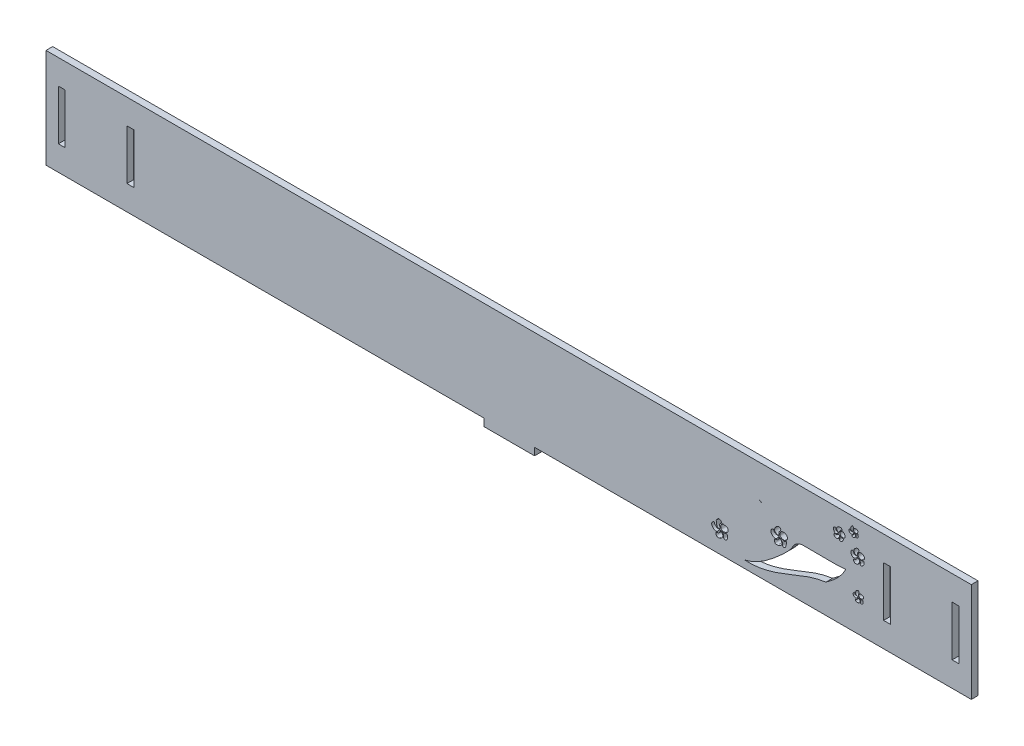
from build123d import *

# Parameters (mm, degrees)
SKETCH1_W           = 2.76
SKETCH1_H           = 20.24
BOSS_EXTRUDE1_DEPTH = 2.7


with BuildPart() as part:
    # Sketch1 → Boss-Extrude1 (new body)
    with BuildSketch(Plane.XY):
        Polygon((67.19335, -20.12), (187.24385, -20.12), (187.24385, 20.12), (67.19335, 20.12), (63.19335, 20.12), (59.19335, 20.12), (55.19335, 20.12), (51.19335, 20.12), (47.19335, 20.12), (43.19335, 20.12), (39.19335, 20.12), (35.19335, 20.12), (31.19335, 20.12), (27.19335, 20.12), (23.19335, 20.12), (19.19335, 20.12), (-19.19335, 20.12), (-23.19335, 20.12), (-27.19335, 20.12), (-31.19335, 20.12), (-35.19335, 20.12), (-39.19335, 20.12), (-43.19335, 20.12), (-47.19335, 20.12), (-51.19335, 20.12), (-55.19335, 20.12), (-59.19335, 20.12), (-63.19335, 20.12), (-67.19335, 20.12), (-187.24385, 20.12), (-187.24385, -20.12), (-67.19335, -20.12), (-63.19335, -20.12), (-59.19335, -20.12), (-55.19335, -20.12), (-51.19335, -20.12), (-47.19335, -20.12), (-43.19335, -20.12), (-39.19335, -20.12), (-35.19335, -20.12), (-31.19335, -20.12), (-27.19335, -20.12), (-23.19335, -20.12), (-19.19335, -20.12), (-10, -20.12), (-10, -23.12), (10.48, -23.12), (10.48, -20.12), (19.19335, -20.12), (23.19335, -20.12), (27.19335, -20.12), (31.19335, -20.12), (35.19335, -20.12), (39.19335, -20.12), (43.19335, -20.12), (47.19335, -20.12), (51.19335, -20.12), (55.19335, -20.12), (59.19335, -20.12), (63.19335, -20.12), align=None)
        with BuildLine():
            add(Edge.make_bspline(
                [(85.691208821, -11.629466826), (85.589736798, -11.701100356), (85.568065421, -12.501909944), (84.868688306, -13.026090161), (83.77266919, -12.995510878), (83.850437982, -13.919274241), (84.300409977, -14.683280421), (85.491883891, -14.55872955), (86.452284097, -14.04142668), (86.780966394, -13.003418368), (86.459408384, -12.29576332), (85.839726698, -11.524621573), (85.691208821, -11.629466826)],
                knots=[0, 0, 0, 0, 0.075265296, 0.187026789, 0.289937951, 0.357125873, 0.446991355, 0.565876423, 0.707167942, 0.80339137, 0.889839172, 1, 1, 1, 1], degree=3))
        make_face(mode=Mode.SUBTRACT)
        with BuildLine():
            add(Edge.make_bspline(
                [(86.432511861, -11.805824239), (86.713984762, -11.964088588), (87.172054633, -12.325145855), (86.80958714, -13.260530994), (87.242146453, -14.188692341), (88.248698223, -13.965769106), (88.534505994, -13.039179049), (88.82888956, -12.140846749), (88.108560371, -11.478496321), (87.364622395, -12.001065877), (86.903284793, -11.638740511), (86.004626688, -11.581726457), (86.308465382, -11.73607637), (86.432511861, -11.805824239)],
                knots=[0, 0, 0, 0, 0.08794937, 0.226053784, 0.303514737, 0.41397192, 0.497666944, 0.652858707, 0.716899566, 0.793639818, 0.918274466, 0.961240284, 1, 1, 1, 1], degree=3))
        make_face(mode=Mode.SUBTRACT)
        with BuildLine():
            add(Edge.make_bspline(
                [(85.280060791, -11.441454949), (85.394727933, -11.551297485), (84.867930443, -12.334666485), (84.136238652, -12.889404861), (82.925899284, -12.578630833), (82.310756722, -11.667626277), (81.923273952, -10.617447), (83.445017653, -9.375109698), (83.214549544, -10.65818582), (83.946771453, -10.840914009), (84.181433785, -11.734521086), (85.162453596, -11.328796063), (85.280060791, -11.441454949)],
                knots=[0, 0, 0, 0, 0.10199793, 0.185703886, 0.326433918, 0.436782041, 0.541149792, 0.680555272, 0.756146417, 0.810860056, 0.895386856, 1, 1, 1, 1], degree=3))
        make_face(mode=Mode.SUBTRACT)
        with BuildLine():
            add(Edge.make_bspline(
                [(86.033814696, -9.507251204), (85.937882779, -9.644886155), (85.758543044, -9.865106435), (85.912857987, -10.427810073), (85.859582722, -11.268606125), (87.040793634, -11.527200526), (88.01499899, -11.282084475), (89.142576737, -10.492096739), (88.511013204, -9.02695692), (87.483461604, -9.049517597), (86.553054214, -8.60235734), (86.234427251, -9.219429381), (86.033814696, -9.507251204)],
                knots=[0, 0, 0, 0, 0.051731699, 0.092374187, 0.189483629, 0.301367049, 0.422502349, 0.551053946, 0.699608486, 0.809479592, 0.891818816, 1, 1, 1, 1], degree=3))
        make_face(mode=Mode.SUBTRACT)
        with BuildLine():
            add(Edge.make_bspline(
                [(85.691208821, -9.209468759), (85.880000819, -9.01031994), (86.55518064, -8.569722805), (85.154913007, -7.59084932), (84.48124911, -8.188968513), (83.446704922, -9.52015991), (84.443475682, -8.335252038), (83.589297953, -11.36284914), (85.845433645, -11.204830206), (85.210509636, -10.069054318), (85.43671663, -9.477921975), (85.691208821, -9.209468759)],
                knots=[0, 0, 0, 0, 0.080332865, 0.207517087, 0.3276429, 0.435043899, 0.463967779, 0.687207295, 0.800208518, 0.891711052, 1, 1, 1, 1], degree=3))
        make_face(mode=Mode.SUBTRACT)
        with BuildLine():
            add(Edge.make_bspline(
                [(95.428484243, -17.104145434), (103.60706231, -17.662234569), (112.603852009, -13.272461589), (123.327129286, -9.359284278), (126.883723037, -8.624225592), (128.385653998, -8.432694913)],
                knots=[0, 0, 0, 0, 0.413763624, 0.525137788, 0.605191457, 0.605191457, 0.605191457, 0.605191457], degree=3))
            add(Edge.make_bspline(
                [(95.428484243, -17.104145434), (97.925750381, -16.576629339), (100.321866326, -15.433862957), (102.606928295, -13.977646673)],
                knots=[0.27583523, 0.27583523, 0.27583523, 0.27583523, 0.360110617, 0.360110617, 0.360110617, 0.360110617], degree=3))
            add(Edge.make_bspline(
                [(102.606928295, -13.977646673), (104.739452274, -12.618639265), (109.048734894, -9.16409178), (112.88857292, -5.585463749), (114.593610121, -3.470460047)],
                knots=[0.360110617, 0.360110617, 0.360110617, 0.360110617, 0.438760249, 0.526592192, 0.526592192, 0.526592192, 0.526592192], degree=3))
            add(Edge.make_bspline(
                [(114.593610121, -3.470460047), (115.024693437, -2.446499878), (115.561076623, -1.725947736), (116.172770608, -1.222005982)],
                knots=[0, 0, 0, 0, 0.059540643, 0.059540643, 0.059540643, 0.059540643], degree=3))
            add(Edge.make_bspline(
                [(116.172770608, -1.222005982), (116.202781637, -1.19728151), (116.232973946, -1.173078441), (116.263343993, -1.149386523)],
                knots=[0.059540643, 0.059540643, 0.059540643, 0.059540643, 0.062461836, 0.062461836, 0.062461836, 0.062461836], degree=3))
            add(Edge.make_bspline(
                [(116.263343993, -1.149386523), (117.642650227, -0.073378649), (119.38857327, -0.051709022), (121.169334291, -0.124107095)],
                knots=[0.062461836, 0.062461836, 0.062461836, 0.062461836, 0.195132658, 0.195132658, 0.195132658, 0.195132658], degree=3))
            add(Edge.make_bspline(
                [(121.169334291, -0.124107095), (121.629806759, -0.142827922), (123.304556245, -0.233334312), (126.580276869, -0.143818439), (129.424948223, -0.215659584), (131.08587856, -0.21527096)],
                knots=[0.195132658, 0.195132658, 0.195132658, 0.195132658, 0.229438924, 0.319277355, 0.444598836, 0.444598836, 0.444598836, 0.444598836], degree=3))
            add(Edge.make_bspline(
                [(131.08587856, -0.21527096), (131.814571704, -0.215100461), (133.580745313, -0.195005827), (135.350199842, -0.08131997), (136.3787052, 0.051839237)],
                knots=[0.444598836, 0.444598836, 0.444598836, 0.444598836, 0.499580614, 0.577719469, 0.577719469, 0.577719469, 0.577719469], degree=3))
            add(Edge.make_bspline(
                [(128.385653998, -8.432694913), (131.32934332, -6.43576585), (134.746811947, -3.471386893), (136.378705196, 0.051839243)],
                knots=[0, 0, 0, 0, 0.363204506, 0.363204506, 0.363204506, 0.363204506], degree=3))
        make_face(mode=Mode.SUBTRACT)
        with BuildLine():
            add(Edge.make_bspline(
                [(141.402688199, -7.170907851), (141.39146153, -7.273920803), (141.052299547, -7.60814698), (140.62527307, -8.074526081), (139.820404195, -7.834301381), (139.381143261, -7.220069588), (139.428655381, -6.573001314), (139.793091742, -6.173614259), (140.183808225, -6.290966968), (140.040362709, -6.654141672), (140.593369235, -6.995707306), (141.425363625, -6.962844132), (141.402688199, -7.170907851)],
                knots=[0, 0, 0, 0, 0.090776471, 0.189914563, 0.341830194, 0.449424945, 0.577206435, 0.658710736, 0.698924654, 0.742702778, 0.816651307, 1, 1, 1, 1], degree=3))
        make_face(mode=Mode.SUBTRACT)
        with BuildLine():
            add(Edge.make_bspline(
                [(141.576739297, -7.323653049), (141.483592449, -7.348877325), (141.423247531, -7.7168239), (141.121087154, -7.956078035), (140.853274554, -8.365316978), (140.182525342, -8.203769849), (140.396011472, -8.939439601), (140.907546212, -9.331880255), (141.676547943, -9.12691498), (142.383873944, -8.578336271), (142.091236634, -7.882976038), (141.94017327, -7.452129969), (141.63724352, -7.307268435), (141.576739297, -7.323653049)],
                knots=[0, 0, 0, 0, 0.061184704, 0.137030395, 0.211409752, 0.291420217, 0.380163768, 0.476645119, 0.618223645, 0.756416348, 0.863865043, 0.960257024, 1, 1, 1, 1], degree=3))
        make_face(mode=Mode.SUBTRACT)
        with BuildLine():
            add(Edge.make_bspline(
                [(141.966282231, -7.400025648), (141.940700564, -7.426443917), (142.22113871, -7.631450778), (142.369834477, -7.840826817), (142.444623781, -8.194660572), (142.418967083, -8.50682055), (142.476125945, -8.982696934), (143.135924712, -8.841535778), (143.421333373, -8.392213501), (143.518681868, -7.892848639), (143.490473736, -7.528518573), (143.28317469, -7.26140788), (143.015087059, -7.398403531), (142.784139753, -7.599458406), (142.424464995, -7.493187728), (142.217086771, -7.402602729), (141.983808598, -7.381926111), (141.966282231, -7.400025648)],
                knots=[0, 0, 0, 0, 0.046628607, 0.119057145, 0.184801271, 0.238324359, 0.311395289, 0.406844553, 0.522698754, 0.614038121, 0.695680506, 0.731874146, 0.783600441, 0.838368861, 0.90809593, 0.96805407, 1, 1, 1, 1], degree=3))
        make_face(mode=Mode.SUBTRACT)
        with BuildLine():
            add(Edge.make_bspline(
                [(109.607533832, -2.201615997), (109.443624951, -2.245707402), (109.194038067, -3.027379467), (108.621320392, -3.636213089), (107.542476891, -3.520609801), (107.62088181, -4.391921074), (107.770292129, -5.261670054), (109.011747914, -5.271109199), (109.871273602, -4.883192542), (110.695249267, -4.271141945), (110.563418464, -3.473854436), (110.314503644, -2.866461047), (109.817718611, -2.1450764), (109.607533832, -2.201615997)],
                knots=[0, 0, 0, 0, 0.083417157, 0.19007709, 0.279913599, 0.333662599, 0.43009958, 0.53451124, 0.659526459, 0.757414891, 0.822628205, 0.893031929, 1, 1, 1, 1], degree=3))
        make_face(mode=Mode.SUBTRACT)
        with BuildLine():
            add(Edge.make_bspline(
                [(110.08293485, -2.306774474), (109.951298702, -2.460804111), (110.692616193, -2.916917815), (110.969700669, -3.596374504), (110.578760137, -4.465153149), (111.551302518, -4.997016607), (112.1191649, -4.262207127), (112.334238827, -3.537183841), (112.554431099, -1.813628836), (111.689500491, -2.62198687), (110.964965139, -2.558317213), (110.49439073, -2.091528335), (110.124679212, -2.257928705), (110.08293485, -2.306774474)],
                knots=[0, 0, 0, 0, 0.09259401, 0.185759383, 0.279650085, 0.379186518, 0.456818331, 0.562892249, 0.722150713, 0.79036066, 0.882183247, 0.970636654, 1, 1, 1, 1], degree=3))
        make_face(mode=Mode.SUBTRACT)
        with BuildLine():
            add(Edge.make_bspline(
                [(109.306161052, -1.959476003), (109.414143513, -2.110695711), (108.814167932, -2.764924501), (108.24382305, -3.431001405), (106.924355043, -3.232220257), (106.1236385, -2.196405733), (106.040373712, -0.960564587), (107.126714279, -0.312896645), (107.337502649, -0.947657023), (107.631524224, -1.38432345), (108.188739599, -1.687286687), (108.71998637, -1.820725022), (109.228076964, -1.850126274), (109.306161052, -1.959476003)],
                knots=[0, 0, 0, 0, 0.095780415, 0.191018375, 0.317375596, 0.467956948, 0.603301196, 0.699208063, 0.733225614, 0.800094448, 0.879425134, 0.930739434, 1, 1, 1, 1], degree=3))
        make_face(mode=Mode.SUBTRACT)
        with BuildLine():
            add(Edge.make_bspline(
                [(142.318532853, -5.630395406), (142.226341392, -5.650569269), (141.953069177, -5.797604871), (141.633196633, -6.13556011), (141.623844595, -6.732491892), (142.195957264, -7.220498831), (142.983985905, -7.176920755), (143.5912133, -6.808368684), (143.807564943, -6.178159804), (143.306312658, -5.663843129), (142.764831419, -5.645756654), (142.428436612, -5.606345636), (142.318532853, -5.630395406)],
                knots=[0, 0, 0, 0, 0.05135983, 0.161454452, 0.230397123, 0.346418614, 0.51352863, 0.619194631, 0.712556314, 0.824532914, 0.938772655, 1, 1, 1, 1], degree=3))
        make_face(mode=Mode.SUBTRACT)
        with BuildLine():
            add(Edge.make_bspline(
                [(141.352959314, -4.875364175), (141.162317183, -4.870451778), (140.849307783, -5.096639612), (140.457253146, -5.493523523), (140.415023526, -6.042592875), (140.409876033, -6.671452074), (140.934102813, -6.833462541), (141.635976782, -7.135128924), (141.410713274, -6.301446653), (141.606899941, -5.812334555), (142.044863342, -5.176554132), (141.56339868, -4.880786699), (141.352959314, -4.875364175)],
                knots=[0, 0, 0, 0, 0.097676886, 0.191142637, 0.285766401, 0.39017868, 0.474106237, 0.573938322, 0.666831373, 0.790538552, 0.892179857, 1, 1, 1, 1], degree=3))
        make_face(mode=Mode.SUBTRACT)
        with Locations((-180.86385, 0)):
            Rectangle(SKETCH1_W, SKETCH1_H, mode=Mode.SUBTRACT)
        with Locations((-153.10385, -0.0505)):
            Rectangle(SKETCH1_W, SKETCH1_H, mode=Mode.SUBTRACT)
        with BuildLine():
            add(Edge.make_bspline(
                [(109.860999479, -0.562996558), (109.768958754, -0.896590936), (109.553919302, -1.575192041), (110.639526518, -2.051111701), (111.756361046, -2.455973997), (112.902232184, -1.447432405), (112.761518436, 0.081023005), (111.352440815, 0.719128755), (110.069765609, 0.264200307), (109.921475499, -0.343805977), (109.860999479, -0.562996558)],
                knots=[0, 0, 0, 0, 0.106527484, 0.195929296, 0.343509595, 0.489058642, 0.617229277, 0.79130786, 0.930005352, 1, 1, 1, 1], degree=3))
        make_face(mode=Mode.SUBTRACT)
        with BuildLine():
            add(Edge.make_bspline(
                [(109.432981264, -1.514148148), (109.575280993, -1.275442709), (109.090100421, -0.168988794), (110.24430427, 0.308959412), (110.019206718, 1.576358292), (108.489588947, 1.413873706), (107.761477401, 0.445984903), (107.297740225, -1.074322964), (109.204517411, -1.89739248), (109.432981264, -1.514148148)],
                knots=[0, 0, 0, 0, 0.142558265, 0.262547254, 0.347103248, 0.493571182, 0.657530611, 0.771121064, 1, 1, 1, 1], degree=3))
        make_face(mode=Mode.SUBTRACT)
        with Locations((153.10385, -0.0505)):
            Rectangle(SKETCH1_W, SKETCH1_H, mode=Mode.SUBTRACT)
        with Locations((180.86385, 0)):
            Rectangle(SKETCH1_W, SKETCH1_H, mode=Mode.SUBTRACT)
        with BuildLine():
            add(Edge.make_bspline(
                [(102.818957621, 6.070755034), (102.413222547, 6.422560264), (101.955631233, 6.727692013), (101.460338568, 6.988535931)],
                knots=[0.678241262, 0.678241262, 0.678241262, 0.678241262, 0.73378541, 0.73378541, 0.73378541, 0.73378541], degree=3))
            add(Edge.make_bspline(
                [(102.818957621, 6.070755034), (102.32097828, 6.31248735), (101.866875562, 6.623572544), (101.460338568, 6.988535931)],
                knots=[0, 0, 0, 0, 0.150230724, 0.150230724, 0.150230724, 0.150230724], degree=3))
        make_face(mode=Mode.SUBTRACT)
        with BuildLine():
            add(Edge.make_bspline(
                [(141.129179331, 6.855278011), (141.149267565, 6.754781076), (140.791805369, 6.29552277), (140.420444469, 5.920791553), (139.769699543, 5.695279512), (139.136244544, 5.845790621), (138.692675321, 6.340298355), (138.477979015, 6.923113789), (138.388231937, 7.584631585), (138.753366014, 8.006946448), (139.245231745, 8.231369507), (139.595033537, 7.774311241), (139.769284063, 7.29199601), (140.283577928, 6.851617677), (141.096306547, 7.019733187), (141.129179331, 6.855278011)],
                knots=[0, 0, 0, 0, 0.069441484, 0.158696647, 0.229311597, 0.320521, 0.393057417, 0.475982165, 0.562543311, 0.630118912, 0.682825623, 0.741768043, 0.817310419, 0.88636458, 1, 1, 1, 1], degree=3))
        make_face(mode=Mode.SUBTRACT)
        with BuildLine():
            add(Edge.make_bspline(
                [(141.352959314, 6.664650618), (141.273178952, 6.667033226), (141.109468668, 6.2481553), (140.886514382, 5.935382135), (140.504775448, 5.598897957), (140.105985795, 5.380060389), (139.363511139, 5.326079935), (139.705044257, 4.305317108), (140.502869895, 3.989516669), (141.311969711, 4.217834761), (141.860911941, 4.713604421), (142.117176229, 5.27974116), (142.015970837, 5.940715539), (141.637574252, 6.233254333), (141.42344618, 6.662545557), (141.352959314, 6.664650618)],
                knots=[0, 0, 0, 0, 0.052215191, 0.116133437, 0.175167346, 0.241762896, 0.300462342, 0.418362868, 0.506127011, 0.631298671, 0.721071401, 0.789499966, 0.868824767, 0.953867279, 1, 1, 1, 1], degree=3))
        make_face(mode=Mode.SUBTRACT)
        with BuildLine():
            add(Edge.make_bspline(
                [(141.66790892, 6.581769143), (141.690999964, 6.547137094), (141.995253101, 6.353724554), (142.142502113, 6.075085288), (142.243419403, 5.703344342), (142.398417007, 5.276633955), (142.086797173, 4.743508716), (142.720194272, 4.311863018), (143.352443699, 4.676967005), (143.851378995, 5.309465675), (143.905030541, 6.85388932), (143.223575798, 6.423814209), (142.814146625, 6.277285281), (142.383230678, 6.34044574), (141.62760162, 6.642222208), (141.66790892, 6.581769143)],
                knots=[0, 0, 0, 0, 0.053684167, 0.096580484, 0.141515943, 0.210715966, 0.27882019, 0.353976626, 0.446762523, 0.545131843, 0.727733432, 0.780080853, 0.825007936, 0.90628991, 1, 1, 1, 1], degree=3))
        make_face(mode=Mode.SUBTRACT)
        with BuildLine():
            add(Edge.make_bspline(
                [(141.576739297, 7.072853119), (141.421858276, 7.300710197), (141.437052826, 7.94986225), (141.709618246, 8.771489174), (142.477140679, 8.923195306), (143.129337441, 8.913393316), (143.613174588, 8.524274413), (144.000643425, 8.154491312), (144.158627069, 7.540008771), (143.726994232, 7.085709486), (143.335657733, 6.750421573), (142.826664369, 6.50735703), (142.200448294, 6.645077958), (141.712298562, 6.873421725), (141.576739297, 7.072853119)],
                knots=[0, 0, 0, 0, 0.114408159, 0.225492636, 0.303072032, 0.397056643, 0.471281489, 0.536042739, 0.606288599, 0.68960545, 0.757136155, 0.81207737, 0.899864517, 1, 1, 1, 1], degree=3))
        make_face(mode=Mode.SUBTRACT)
        with BuildLine():
            add(Edge.make_bspline(
                [(141.228637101, 7.072853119), (141.126771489, 6.9453004), (140.41923142, 7.264521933), (139.86126217, 7.612505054), (139.65152652, 8.372770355), (139.918681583, 9.049169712), (140.426958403, 9.444373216), (140.899023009, 9.763675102), (141.447245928, 9.80027026), (141.794779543, 9.379983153), (141.742480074, 8.849416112), (141.254983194, 8.660103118), (141.228981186, 8.101054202), (141.196758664, 7.645280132), (141.30223088, 7.165004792), (141.228637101, 7.072853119)],
                knots=[0, 0, 0, 0, 0.097571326, 0.200858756, 0.292317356, 0.379769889, 0.477284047, 0.544714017, 0.607419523, 0.676148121, 0.735417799, 0.790351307, 0.858739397, 0.929508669, 1, 1, 1, 1], degree=3))
        make_face(mode=Mode.SUBTRACT)
        with BuildLine():
            add(Edge.make_bspline(
                [(131.888224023, 10.439208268), (131.742003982, 10.348642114), (131.616689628, 9.877017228), (131.974476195, 9.247600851), (132.79114405, 8.994682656), (133.432813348, 9.367703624), (133.958168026, 9.810791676), (134.027199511, 10.516560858), (133.59809331, 10.90260309), (133.136861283, 10.556658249), (132.604436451, 10.348776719), (132.041731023, 10.534287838), (131.888224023, 10.439208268)],
                knots=[0, 0, 0, 0, 0.093634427, 0.177256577, 0.340726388, 0.435003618, 0.526354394, 0.669425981, 0.708015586, 0.771149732, 0.901699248, 1, 1, 1, 1], degree=3))
        make_face(mode=Mode.SUBTRACT)
        with BuildLine():
            add(Edge.make_bspline(
                [(134.063245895, 10.819006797), (134.037426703, 10.779500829), (134.133253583, 10.46683813), (134.16862763, 10.149016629), (134.104574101, 9.743926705), (133.87943454, 9.436652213), (133.895538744, 9.036126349), (134.301910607, 8.719388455), (134.885127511, 8.964538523), (135.250483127, 9.452064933), (135.480841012, 9.910536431), (135.360266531, 10.446741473), (134.799889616, 10.235751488), (134.514180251, 10.530637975), (134.102226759, 10.878651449), (134.063245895, 10.819006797)],
                knots=[0, 0, 0, 0, 0.051496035, 0.117059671, 0.1933341, 0.251766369, 0.313751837, 0.38233918, 0.485779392, 0.600045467, 0.702107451, 0.753345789, 0.834839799, 0.922253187, 1, 1, 1, 1], degree=3))
        make_face(mode=Mode.SUBTRACT)
        with BuildLine():
            add(Edge.make_bspline(
                [(132.139615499, 12.739099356), (131.848526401, 12.669392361), (131.32623579, 12.351016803), (131.486663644, 11.464232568), (131.882059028, 10.61317437), (132.756500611, 10.673854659), (133.705968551, 11.265634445), (132.881374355, 11.626128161), (132.335015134, 11.994409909), (132.688998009, 12.81904443), (132.268789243, 12.770032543), (132.139615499, 12.739099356)],
                knots=[0, 0, 0, 0, 0.120817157, 0.267391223, 0.373579, 0.534133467, 0.642234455, 0.746668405, 0.839106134, 0.946386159, 1, 1, 1, 1], degree=3))
        make_face(mode=Mode.SUBTRACT)
        with BuildLine():
            add(Edge.make_bspline(
                [(134.777105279, 12.584392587), (134.365093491, 12.443740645), (133.729382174, 11.735133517), (134.461172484, 10.630021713), (135.457926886, 10.528553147), (136.313240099, 11.012261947), (136.099490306, 11.909485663), (135.624337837, 12.663557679), (134.998121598, 12.659842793), (134.777105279, 12.584392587)],
                knots=[0, 0, 0, 0, 0.190555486, 0.3392957, 0.515540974, 0.62494544, 0.729723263, 0.897779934, 1, 1, 1, 1], degree=3))
        make_face(mode=Mode.SUBTRACT)
        with BuildLine():
            add(Edge.make_bspline(
                [(133.426710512, 13.510347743), (133.168242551, 13.389642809), (132.637309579, 13.013916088), (132.708799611, 12.05966088), (133.650262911, 11.375655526), (133.835550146, 12.152112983), (134.135381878, 12.674986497), (134.966472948, 12.598564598), (134.942487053, 13.600658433), (134.139423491, 13.736864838), (133.69485483, 13.635571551), (133.426710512, 13.510347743)],
                knots=[0, 0, 0, 0, 0.128990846, 0.270690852, 0.402641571, 0.471458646, 0.577971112, 0.66325031, 0.782896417, 0.866180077, 1, 1, 1, 1], degree=3))
        make_face(mode=Mode.SUBTRACT)
        with BuildLine():
            add(Edge.make_bspline(
                [(139.728482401, 14.503000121), (139.665688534, 14.475997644), (139.612097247, 14.206080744), (139.529638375, 13.848181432), (139.230483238, 13.522671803), (138.780024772, 13.375288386), (138.946016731, 12.866416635), (139.512110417, 12.720273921), (140.020068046, 13.018295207), (140.502243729, 13.416437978), (140.393287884, 14.056545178), (140.098313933, 14.481411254), (139.762034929, 14.517428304), (139.728482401, 14.503000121)],
                knots=[0, 0, 0, 0, 0.046365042, 0.131964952, 0.238953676, 0.300177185, 0.377166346, 0.476897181, 0.614688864, 0.724026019, 0.819302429, 0.975225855, 1, 1, 1, 1], degree=3))
        make_face(mode=Mode.SUBTRACT)
        with BuildLine():
            add(Edge.make_bspline(
                [(138.284229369, 15.00240448), (138.18925473, 15.08053104), (137.888934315, 15.117624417), (137.67320482, 14.645049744), (137.758223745, 14.069207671), (138.299418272, 13.659984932), (139.039961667, 13.500578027), (139.418469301, 14.010431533), (139.579357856, 14.643736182), (138.988737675, 14.613904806), (138.47156952, 14.552479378), (138.379233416, 14.924253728), (138.284229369, 15.00240448)],
                knots=[0, 0, 0, 0, 0.070069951, 0.134980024, 0.270169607, 0.380959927, 0.521230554, 0.652809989, 0.7353486, 0.809874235, 0.929908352, 1, 1, 1, 1], degree=3))
        make_face(mode=Mode.SUBTRACT)
        with BuildLine():
            add(Edge.make_bspline(
                [(140.232427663, 14.458557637), (140.227064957, 14.433333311), (140.661664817, 14.209931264), (140.700470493, 13.834406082), (140.595856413, 13.443881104), (140.944870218, 13.207195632), (141.349595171, 13.509532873), (141.538123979, 14.005875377), (141.426893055, 14.422012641), (141.263099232, 14.992217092), (140.886113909, 14.608133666), (140.650660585, 14.403400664), (140.238557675, 14.48739111), (140.232427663, 14.458557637)],
                knots=[0, 0, 0, 0, 0.074019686, 0.202264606, 0.260051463, 0.324791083, 0.42805168, 0.549513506, 0.664213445, 0.749567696, 0.8421891, 0.915389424, 1, 1, 1, 1], degree=3))
        make_face(mode=Mode.SUBTRACT)
        with BuildLine():
            add(Edge.make_bspline(
                [(139.537855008, 16.209098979), (139.523469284, 16.036285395), (139.202364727, 15.73170872), (139.483019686, 15.27954437), (139.395141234, 14.713493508), (138.908618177, 14.853582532), (138.565068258, 15.011379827), (138.403965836, 15.453466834), (138.438074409, 15.891543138), (138.675319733, 16.299559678), (138.881475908, 16.634264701), (139.329172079, 16.737136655), (139.554112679, 16.404399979), (139.537855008, 16.209098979)],
                knots=[0, 0, 0, 0, 0.1047253, 0.223158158, 0.304217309, 0.37246449, 0.479984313, 0.53642999, 0.651333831, 0.739775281, 0.83132088, 0.881647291, 1, 1, 1, 1], degree=3))
        make_face(mode=Mode.SUBTRACT)
        with BuildLine():
            add(Edge.make_bspline(
                [(139.728482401, 15.975663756), (139.649407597, 15.841294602), (139.620133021, 15.494520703), (139.629180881, 14.96367673), (140.206107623, 14.678929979), (140.823813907, 14.773461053), (141.25338407, 15.195211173), (141.451150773, 15.774620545), (140.837601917, 16.456831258), (139.924806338, 16.309270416), (139.728482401, 15.975663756)],
                knots=[0, 0, 0, 0, 0.096950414, 0.194426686, 0.285269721, 0.432486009, 0.534979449, 0.62996595, 0.759295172, 1, 1, 1, 1], degree=3))
        make_face(mode=Mode.SUBTRACT)
    extrude(amount=BOSS_EXTRUDE1_DEPTH)


solid = part.part
